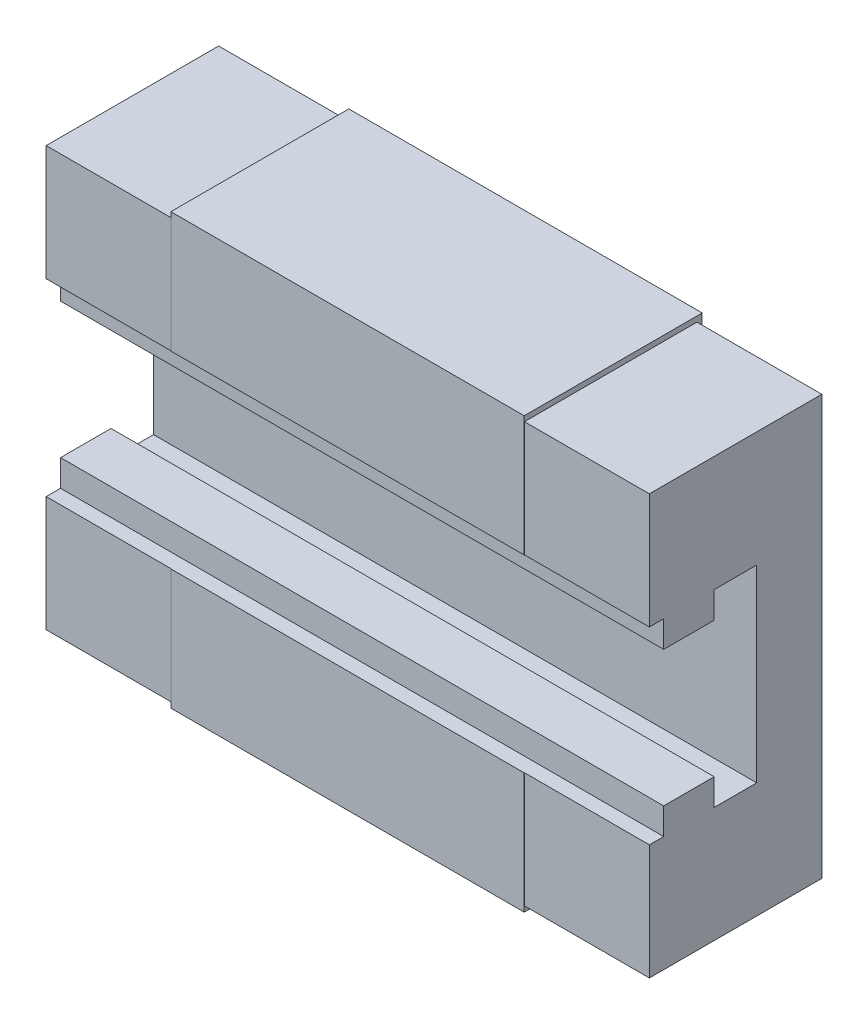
from build123d import *

# Parameters (mm, degrees)
SKETCH_1_W          = 13.3
SKETCH_1_H          = 16.18
EXTRUDE_1_DEPTH     = 6.7
SKETCH_2_W          = 0.2
SKETCH_2_H          = 15.78
SKETCH_2_W_2        = 6.3
EXTRUDE_2_DEPTH     = 4.7
EXTRUDE_3_DEPTH     = 4.7
CUT_EXTRUDE_2_DEPTH = 29.670061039
SKETCH_5_R          = 1.05
CUT_EXTRUDE_3_DEPTH = 5
SKETCH_6_W          = 4.7
SKETCH_6_H          = 4.34
CUT_EXTRUDE_4_DEPTH = 0.01


with BuildPart() as part:
    # Sketch 1 → Extrude 1 (new body)
    with BuildSketch(Plane.XY):
        with Locations((6.65, 8.09)):
            Rectangle(SKETCH_1_W, SKETCH_1_H)
    extrude(amount=EXTRUDE_1_DEPTH)

    # Sketch 2 → Extrude 2 (add)
    with BuildSketch(Plane(origin=(13.3, 0, 0), x_dir=(0, 0, -1), z_dir=(1, 0, 0))):
        with Locations((-6.6, 8.09)):
            Rectangle(SKETCH_2_W, SKETCH_2_H)
        with Locations((-3.35, 8.09)):
            Rectangle(SKETCH_2_W_2, SKETCH_2_H)
    extrude(amount=EXTRUDE_2_DEPTH)

    # Sketch 3 → Extrude 3 (add)
    with BuildSketch(Plane.ZY):
        Polygon((6.7, 0.2), (6.7, 15.98), (6.5, 15.98), (0.2, 15.98), (0.2, 0.2), (6.5, 0.2), align=None)
    extrude(amount=EXTRUDE_3_DEPTH)

    # Sketch 4 → Cut-Extrude 2 (cut, through all)
    with BuildSketch(Plane(origin=(18, 0, 0), x_dir=(0, 0, -1), z_dir=(1, 0, 0))):
        Polygon((-2.65, 11.64), (-4.25, 11.64), (-4.25, 10.64), (-6.15, 10.64), (-6.15, 11.64), (-7.75, 11.64), (-7.75, 4.54), (-6.15, 4.54), (-6.15, 5.54), (-4.25, 5.54), (-4.25, 4.54), (-2.65, 4.54), align=None)
    extrude(amount=-CUT_EXTRUDE_2_DEPTH, mode=Mode.SUBTRACT)

    # Sketch 5 → Cut-Extrude 3 (cut)
    with BuildSketch(Plane(origin=(0, 0, 0), x_dir=(-1, 0, 0), z_dir=(0, 0, -1))):
        with Locations((-10.65, 14.09)):
            Circle(SKETCH_5_R)
        with Locations((-2.65, 14.09)):
            Circle(SKETCH_5_R)
        with Locations((-10.65, 2.09)):
            Circle(SKETCH_5_R)
        with Locations((-2.65, 2.09)):
            Circle(SKETCH_5_R)
    extrude(amount=-CUT_EXTRUDE_3_DEPTH, mode=Mode.SUBTRACT)

    # Sketch 6 → Cut-Extrude 4 (cut)
    with BuildSketch(Plane.XY.offset(6.7)):
        with Locations((-2.35, 13.81)):
            Rectangle(SKETCH_6_W, SKETCH_6_H)
        with Locations((-2.35, 2.37)):
            Rectangle(SKETCH_6_W, SKETCH_6_H)
        with Locations((15.65, 13.81)):
            Rectangle(SKETCH_6_W, SKETCH_6_H)
        with Locations((15.65, 2.37)):
            Rectangle(SKETCH_6_W, SKETCH_6_H)
    extrude(amount=-CUT_EXTRUDE_4_DEPTH, mode=Mode.SUBTRACT)


solid = part.part
